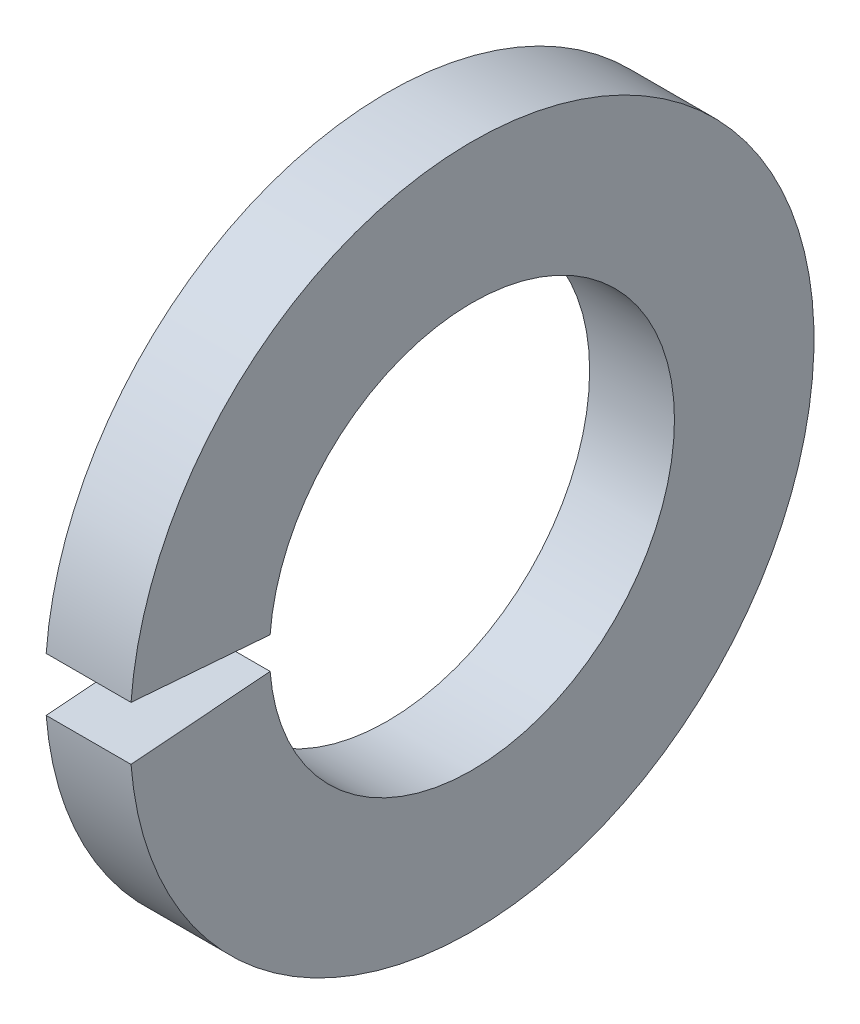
ISO-10303-21;
HEADER;
FILE_DESCRIPTION(('STEP AP214'),'2;1');
FILE_NAME('part.step','',(''),(''),'','','');
FILE_SCHEMA(('AUTOMOTIVE_DESIGN { 1 0 10303 214 1 1 1 1 }'));
ENDSEC;
DATA;
#1=APPLICATION_CONTEXT('core data for automotive mechanical design processes');
#2=APPLICATION_PROTOCOL_DEFINITION('international standard','automotive_design',2000,#1);
#3=PRODUCT_CONTEXT('',#1,'mechanical');
#4=PRODUCT('Part','Part','',(#3));
#5=PRODUCT_RELATED_PRODUCT_CATEGORY('part','',(#4));
#6=PRODUCT_DEFINITION_FORMATION('','',#4);
#7=PRODUCT_DEFINITION_CONTEXT('part definition',#1,'design');
#8=PRODUCT_DEFINITION('design','',#6,#7);
#9=PRODUCT_DEFINITION_SHAPE('','',#8);
#10=(LENGTH_UNIT() NAMED_UNIT(*) SI_UNIT(.MILLI.,.METRE.));
#11=(NAMED_UNIT(*) PLANE_ANGLE_UNIT() SI_UNIT($,.RADIAN.));
#12=(NAMED_UNIT(*) SI_UNIT($,.STERADIAN.) SOLID_ANGLE_UNIT());
#13=UNCERTAINTY_MEASURE_WITH_UNIT(LENGTH_MEASURE(1.E-05),#10,'distance_accuracy_value','');
#14=(GEOMETRIC_REPRESENTATION_CONTEXT(3) GLOBAL_UNCERTAINTY_ASSIGNED_CONTEXT((#13)) GLOBAL_UNIT_ASSIGNED_CONTEXT((#10,
#11,#12)) REPRESENTATION_CONTEXT('',''));
#15=CARTESIAN_POINT('',(0.,0.,0.));
#16=DIRECTION('',(0.,0.,1.));
#17=DIRECTION('',(1.,0.,0.));
#18=AXIS2_PLACEMENT_3D('',#15,#16,#17);
#19=CARTESIAN_POINT('',(-34.925,-2.77555756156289E-13,1.76941794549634E-13));
#20=DIRECTION('',(-1.,0.,0.));
#21=DIRECTION('',(0.,0.,1.));
#22=AXIS2_PLACEMENT_3D('',#19,#20,#21);
#23=CYLINDRICAL_SURFACE('',#22,1.8796);
#24=CARTESIAN_POINT('',(0.,0.,0.));
#25=DIRECTION('',(-1.,0.,0.));
#26=DIRECTION('',(0.,0.,1.));
#27=AXIS2_PLACEMENT_3D('',#24,#25,#26);
#28=CIRCLE('',#27,1.8796);
#29=CARTESIAN_POINT('',(0.,0.147471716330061,1.87380582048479));
#30=VERTEX_POINT('',#29);
#31=CARTESIAN_POINT('',(0.,-0.147471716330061,1.87380582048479));
#32=VERTEX_POINT('',#31);
#33=EDGE_CURVE('E87',#30,#32,#28,.T.);
#34=ORIENTED_EDGE('',*,*,#33,.F.);
#35=DIRECTION('',(-1.,0.,0.));
#36=VECTOR('',#35,1.);
#37=CARTESIAN_POINT('',(-34.925,0.147471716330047,1.87380582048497));
#38=LINE('',#37,#36);
#39=CARTESIAN_POINT('',(-0.787400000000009,0.147471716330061,1.8738058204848));
#40=VERTEX_POINT('',#39);
#41=EDGE_CURVE('E101',#30,#40,#38,.T.);
#42=ORIENTED_EDGE('',*,*,#41,.T.);
#43=CARTESIAN_POINT('',(-0.787400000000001,0.,0.));
#44=DIRECTION('',(-1.,0.,0.));
#45=DIRECTION('',(0.,0.,1.));
#46=AXIS2_PLACEMENT_3D('',#43,#44,#45);
#47=CIRCLE('',#46,1.8796);
#48=CARTESIAN_POINT('',(-0.787400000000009,-0.147471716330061,1.87380582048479));
#49=VERTEX_POINT('',#48);
#50=EDGE_CURVE('E89',#40,#49,#47,.T.);
#51=ORIENTED_EDGE('',*,*,#50,.T.);
#52=DIRECTION('',(-1.,0.,0.));
#53=VECTOR('',#52,1.);
#54=CARTESIAN_POINT('',(-34.925,-0.147471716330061,1.87380582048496));
#55=LINE('',#54,#53);
#56=EDGE_CURVE('E57',#32,#49,#55,.T.);
#57=ORIENTED_EDGE('',*,*,#56,.F.);
#58=EDGE_LOOP('',(#34,#42,#51,#57));
#59=FACE_BOUND('',#58,.T.);
#60=ADVANCED_FACE('F36',(#59),#23,.F.);
#61=CARTESIAN_POINT('',(0.,1.8796,0.));
#62=DIRECTION('',(-1.,0.,0.));
#63=DIRECTION('',(0.,0.,1.));
#64=AXIS2_PLACEMENT_3D('',#61,#62,#63);
#65=PLANE('',#64);
#66=CARTESIAN_POINT('',(0.,0.,0.));
#67=DIRECTION('',(-1.,0.,0.));
#68=DIRECTION('',(0.,0.,1.));
#69=AXIS2_PLACEMENT_3D('',#66,#67,#68);
#70=CIRCLE('',#69,3.175);
#71=CARTESIAN_POINT('',(0.,0.249107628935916,3.16521253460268));
#72=VERTEX_POINT('',#71);
#73=CARTESIAN_POINT('',(0.,-0.249107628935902,3.16521253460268));
#74=VERTEX_POINT('',#73);
#75=EDGE_CURVE('E93',#72,#74,#70,.T.);
#76=ORIENTED_EDGE('',*,*,#75,.F.);
#77=DIRECTION('',(0.,0.0784590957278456,0.996917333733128));
#78=VECTOR('',#77,1.);
#79=CARTESIAN_POINT('',(0.,0.,0.));
#80=LINE('',#79,#78);
#81=EDGE_CURVE('E81',#30,#72,#80,.T.);
#82=ORIENTED_EDGE('',*,*,#81,.F.);
#83=ORIENTED_EDGE('',*,*,#33,.T.);
#84=DIRECTION('',(0.,-0.0784590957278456,0.996917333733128));
#85=VECTOR('',#84,1.);
#86=CARTESIAN_POINT('',(0.,0.,0.));
#87=LINE('',#86,#85);
#88=EDGE_CURVE('E73',#32,#74,#87,.T.);
#89=ORIENTED_EDGE('',*,*,#88,.T.);
#90=EDGE_LOOP('',(#76,#82,#83,#89));
#91=FACE_BOUND('',#90,.T.);
#92=ADVANCED_FACE('F92',(#91),#65,.F.);
#93=CARTESIAN_POINT('',(-34.925,-2.77555756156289E-13,1.76941794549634E-13));
#94=DIRECTION('',(-1.,0.,0.));
#95=DIRECTION('',(0.,0.,1.));
#96=AXIS2_PLACEMENT_3D('',#93,#94,#95);
#97=CYLINDRICAL_SURFACE('',#96,3.175);
#98=CARTESIAN_POINT('',(-0.787400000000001,0.,0.));
#99=DIRECTION('',(-1.,0.,0.));
#100=DIRECTION('',(0.,0.,1.));
#101=AXIS2_PLACEMENT_3D('',#98,#99,#100);
#102=CIRCLE('',#101,3.175);
#103=CARTESIAN_POINT('',(-0.787400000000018,0.249107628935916,3.1652125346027));
#104=VERTEX_POINT('',#103);
#105=CARTESIAN_POINT('',(-0.787400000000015,-0.249107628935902,3.16521253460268));
#106=VERTEX_POINT('',#105);
#107=EDGE_CURVE('E95',#104,#106,#102,.T.);
#108=ORIENTED_EDGE('',*,*,#107,.F.);
#109=DIRECTION('',(-1.,0.,0.));
#110=VECTOR('',#109,1.);
#111=CARTESIAN_POINT('',(-34.925,0.249107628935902,3.16521253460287));
#112=LINE('',#111,#110);
#113=EDGE_CURVE('E50',#104,#72,#112,.F.);
#114=ORIENTED_EDGE('',*,*,#113,.T.);
#115=ORIENTED_EDGE('',*,*,#75,.T.);
#116=DIRECTION('',(-1.,0.,0.));
#117=VECTOR('',#116,1.);
#118=CARTESIAN_POINT('',(-34.925,-0.249107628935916,3.16521253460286));
#119=LINE('',#118,#117);
#120=EDGE_CURVE('E76',#106,#74,#119,.F.);
#121=ORIENTED_EDGE('',*,*,#120,.F.);
#122=EDGE_LOOP('',(#108,#114,#115,#121));
#123=FACE_BOUND('',#122,.T.);
#124=ADVANCED_FACE('F108',(#123),#97,.T.);
#125=CARTESIAN_POINT('',(-0.787400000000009,3.175,0.));
#126=DIRECTION('',(1.,0.,0.));
#127=DIRECTION('',(0.,0.,-1.));
#128=AXIS2_PLACEMENT_3D('',#125,#126,#127);
#129=PLANE('',#128);
#130=ORIENTED_EDGE('',*,*,#50,.F.);
#131=DIRECTION('',(0.,0.0784590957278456,0.996917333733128));
#132=VECTOR('',#131,1.);
#133=CARTESIAN_POINT('',(-0.787399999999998,0.0195447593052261,0.248339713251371));
#134=LINE('',#133,#132);
#135=EDGE_CURVE('E11',#40,#104,#134,.T.);
#136=ORIENTED_EDGE('',*,*,#135,.T.);
#137=ORIENTED_EDGE('',*,*,#107,.T.);
#138=DIRECTION('',(0.,-0.0784590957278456,0.996917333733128));
#139=VECTOR('',#138,1.);
#140=CARTESIAN_POINT('',(-0.787399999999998,0.0195447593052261,-0.248339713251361));
#141=LINE('',#140,#139);
#142=EDGE_CURVE('E43',#49,#106,#141,.T.);
#143=ORIENTED_EDGE('',*,*,#142,.F.);
#144=EDGE_LOOP('',(#130,#136,#137,#143));
#145=FACE_BOUND('',#144,.T.);
#146=ADVANCED_FACE('F110',(#145),#129,.F.);
#147=CARTESIAN_POINT('',(-0.787400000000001,0.,0.));
#148=DIRECTION('',(0.,0.996917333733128,0.0784590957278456));
#149=DIRECTION('',(0.,-0.0784590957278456,0.996917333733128));
#150=AXIS2_PLACEMENT_3D('',#147,#148,#149);
#151=PLANE('',#150);
#152=ORIENTED_EDGE('',*,*,#56,.T.);
#153=ORIENTED_EDGE('',*,*,#142,.T.);
#154=ORIENTED_EDGE('',*,*,#120,.T.);
#155=ORIENTED_EDGE('',*,*,#88,.F.);
#156=EDGE_LOOP('',(#152,#153,#154,#155));
#157=FACE_BOUND('',#156,.T.);
#158=ADVANCED_FACE('F74',(#157),#151,.T.);
#159=CARTESIAN_POINT('',(-0.787400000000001,0.,0.));
#160=DIRECTION('',(0.,0.996917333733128,-0.0784590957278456));
#161=DIRECTION('',(0.,0.0784590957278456,0.996917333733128));
#162=AXIS2_PLACEMENT_3D('',#159,#160,#161);
#163=PLANE('',#162);
#164=ORIENTED_EDGE('',*,*,#81,.T.);
#165=ORIENTED_EDGE('',*,*,#113,.F.);
#166=ORIENTED_EDGE('',*,*,#135,.F.);
#167=ORIENTED_EDGE('',*,*,#41,.F.);
#168=EDGE_LOOP('',(#164,#165,#166,#167));
#169=FACE_BOUND('',#168,.T.);
#170=ADVANCED_FACE('F105',(#169),#163,.F.);
#171=CLOSED_SHELL('',(#60,#92,#124,#146,#158,#170));
#172=MANIFOLD_SOLID_BREP('B2',#171);
#173=ADVANCED_BREP_SHAPE_REPRESENTATION('',(#18,#172),#14);
#174=SHAPE_DEFINITION_REPRESENTATION(#9,#173);
ENDSEC;
END-ISO-10303-21;
